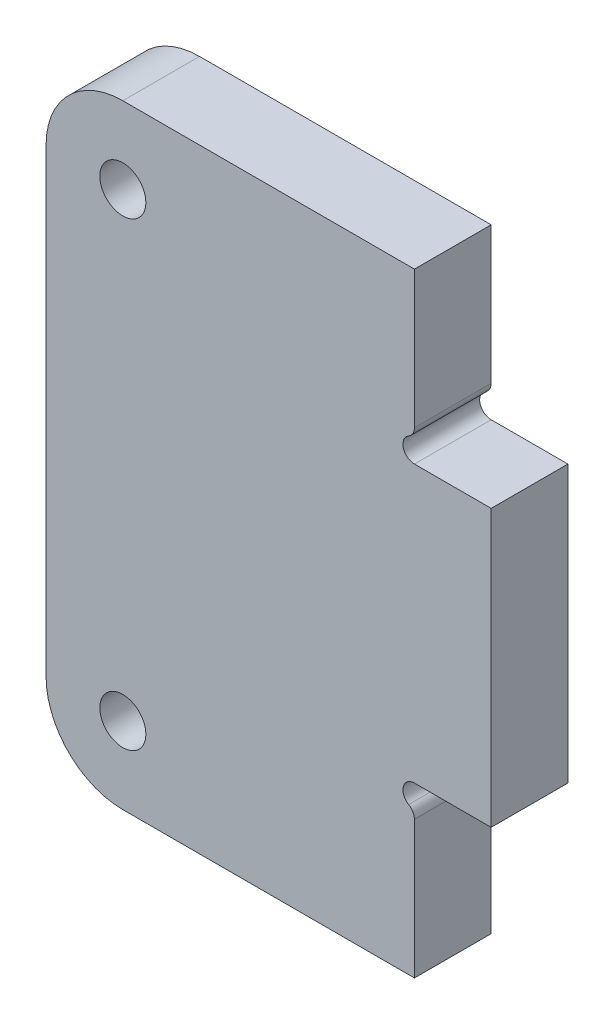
ISO-10303-21;
HEADER;
FILE_DESCRIPTION(('STEP AP214'),'2;1');
FILE_NAME('part.step','',(''),(''),'','','');
FILE_SCHEMA(('AUTOMOTIVE_DESIGN { 1 0 10303 214 1 1 1 1 }'));
ENDSEC;
DATA;
#1=APPLICATION_CONTEXT('core data for automotive mechanical design processes');
#2=APPLICATION_PROTOCOL_DEFINITION('international standard','automotive_design',2000,#1);
#3=PRODUCT_CONTEXT('',#1,'mechanical');
#4=PRODUCT('Part','Part','',(#3));
#5=PRODUCT_RELATED_PRODUCT_CATEGORY('part','',(#4));
#6=PRODUCT_DEFINITION_FORMATION('','',#4);
#7=PRODUCT_DEFINITION_CONTEXT('part definition',#1,'design');
#8=PRODUCT_DEFINITION('design','',#6,#7);
#9=PRODUCT_DEFINITION_SHAPE('','',#8);
#10=(LENGTH_UNIT() NAMED_UNIT(*) SI_UNIT(.MILLI.,.METRE.));
#11=(NAMED_UNIT(*) PLANE_ANGLE_UNIT() SI_UNIT($,.RADIAN.));
#12=(NAMED_UNIT(*) SI_UNIT($,.STERADIAN.) SOLID_ANGLE_UNIT());
#13=UNCERTAINTY_MEASURE_WITH_UNIT(LENGTH_MEASURE(1.E-05),#10,'distance_accuracy_value','');
#14=(GEOMETRIC_REPRESENTATION_CONTEXT(3) GLOBAL_UNCERTAINTY_ASSIGNED_CONTEXT((#13)) GLOBAL_UNIT_ASSIGNED_CONTEXT((#10,
#11,#12)) REPRESENTATION_CONTEXT('',''));
#15=CARTESIAN_POINT('',(0.,0.,0.));
#16=DIRECTION('',(0.,0.,1.));
#17=DIRECTION('',(1.,0.,0.));
#18=AXIS2_PLACEMENT_3D('',#15,#16,#17);
#19=CARTESIAN_POINT('',(26.5465583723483,-22.0980762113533,10.));
#20=DIRECTION('',(0.,0.,1.));
#21=DIRECTION('',(1.,0.,0.));
#22=AXIS2_PLACEMENT_3D('',#19,#20,#21);
#23=PLANE('',#22);
#24=CARTESIAN_POINT('',(-9.95344162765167,-30.,10.));
#25=DIRECTION('',(0.,0.,1.));
#26=DIRECTION('',(1.,0.,0.));
#27=AXIS2_PLACEMENT_3D('',#24,#25,#26);
#28=CIRCLE('',#27,2.9999999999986);
#29=CARTESIAN_POINT('',(-6.95344162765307,-30.,10.));
#30=VERTEX_POINT('',#29);
#31=EDGE_CURVE('E188',#30,#30,#28,.T.);
#32=ORIENTED_EDGE('',*,*,#31,.F.);
#33=EDGE_LOOP('',(#32));
#34=FACE_BOUND('',#33,.T.);
#35=CARTESIAN_POINT('',(26.5465583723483,-22.0980762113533,10.));
#36=DIRECTION('',(0.,0.,1.));
#37=DIRECTION('',(1.,0.,0.));
#38=AXIS2_PLACEMENT_3D('',#35,#36,#37);
#39=CIRCLE('',#38,1.5);
#40=CARTESIAN_POINT('',(28.0465583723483,-22.0980762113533,10.));
#41=VERTEX_POINT('',#40);
#42=CARTESIAN_POINT('',(27.2965583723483,-20.7990381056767,10.));
#43=VERTEX_POINT('',#42);
#44=EDGE_CURVE('E224',#41,#43,#39,.T.);
#45=ORIENTED_EDGE('',*,*,#44,.T.);
#46=CARTESIAN_POINT('',(28.0465583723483,-19.5,10.));
#47=DIRECTION('',(0.,0.,-1.));
#48=DIRECTION('',(1.,0.,0.));
#49=AXIS2_PLACEMENT_3D('',#46,#47,#48);
#50=CIRCLE('',#49,1.5);
#51=CARTESIAN_POINT('',(28.0465583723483,-18.,10.));
#52=VERTEX_POINT('',#51);
#53=EDGE_CURVE('E124',#43,#52,#50,.T.);
#54=ORIENTED_EDGE('',*,*,#53,.T.);
#55=DIRECTION('',(1.,0.,0.));
#56=VECTOR('',#55,1.);
#57=CARTESIAN_POINT('',(28.0465583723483,-18.,10.));
#58=LINE('',#57,#56);
#59=CARTESIAN_POINT('',(38.0465583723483,-18.,10.));
#60=VERTEX_POINT('',#59);
#61=EDGE_CURVE('E269',#52,#60,#58,.T.);
#62=ORIENTED_EDGE('',*,*,#61,.T.);
#63=DIRECTION('',(0.,1.,0.));
#64=VECTOR('',#63,1.);
#65=CARTESIAN_POINT('',(38.0465583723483,-18.,10.));
#66=LINE('',#65,#64);
#67=CARTESIAN_POINT('',(38.0465583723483,18.,10.));
#68=VERTEX_POINT('',#67);
#69=EDGE_CURVE('E289',#60,#68,#66,.T.);
#70=ORIENTED_EDGE('',*,*,#69,.T.);
#71=DIRECTION('',(-1.,0.,0.));
#72=VECTOR('',#71,1.);
#73=CARTESIAN_POINT('',(38.0465583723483,18.,10.));
#74=LINE('',#73,#72);
#75=CARTESIAN_POINT('',(28.0465583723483,18.,10.));
#76=VERTEX_POINT('',#75);
#77=EDGE_CURVE('E285',#68,#76,#74,.T.);
#78=ORIENTED_EDGE('',*,*,#77,.T.);
#79=CARTESIAN_POINT('',(28.0465583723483,19.5,10.));
#80=DIRECTION('',(0.,0.,-1.));
#81=DIRECTION('',(1.,0.,0.));
#82=AXIS2_PLACEMENT_3D('',#79,#80,#81);
#83=CIRCLE('',#82,1.5);
#84=CARTESIAN_POINT('',(27.2965583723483,20.7990381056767,10.));
#85=VERTEX_POINT('',#84);
#86=EDGE_CURVE('E288',#76,#85,#83,.T.);
#87=ORIENTED_EDGE('',*,*,#86,.T.);
#88=CARTESIAN_POINT('',(26.5465583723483,22.0980762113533,10.));
#89=DIRECTION('',(0.,0.,1.));
#90=DIRECTION('',(1.,0.,0.));
#91=AXIS2_PLACEMENT_3D('',#88,#89,#90);
#92=CIRCLE('',#91,1.5);
#93=CARTESIAN_POINT('',(28.0465583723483,22.0980762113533,10.));
#94=VERTEX_POINT('',#93);
#95=EDGE_CURVE('E293',#85,#94,#92,.T.);
#96=ORIENTED_EDGE('',*,*,#95,.T.);
#97=DIRECTION('',(0.,1.,0.));
#98=VECTOR('',#97,1.);
#99=CARTESIAN_POINT('',(28.0465583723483,22.0980762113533,10.));
#100=LINE('',#99,#98);
#101=CARTESIAN_POINT('',(28.0465583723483,40.,10.));
#102=VERTEX_POINT('',#101);
#103=EDGE_CURVE('E300',#94,#102,#100,.T.);
#104=ORIENTED_EDGE('',*,*,#103,.T.);
#105=DIRECTION('',(-1.,0.,0.));
#106=VECTOR('',#105,1.);
#107=CARTESIAN_POINT('',(28.0465583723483,40.,10.));
#108=LINE('',#107,#106);
#109=CARTESIAN_POINT('',(-9.9534416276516,40.,10.));
#110=VERTEX_POINT('',#109);
#111=EDGE_CURVE('E303',#102,#110,#108,.T.);
#112=ORIENTED_EDGE('',*,*,#111,.T.);
#113=CARTESIAN_POINT('',(-9.95344162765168,30.,10.));
#114=DIRECTION('',(0.,0.,1.));
#115=DIRECTION('',(1.,0.,0.));
#116=AXIS2_PLACEMENT_3D('',#113,#114,#115);
#117=CIRCLE('',#116,10.);
#118=CARTESIAN_POINT('',(-19.9534416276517,29.9999999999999,10.));
#119=VERTEX_POINT('',#118);
#120=EDGE_CURVE('E306',#110,#119,#117,.T.);
#121=ORIENTED_EDGE('',*,*,#120,.T.);
#122=DIRECTION('',(0.,-1.,0.));
#123=VECTOR('',#122,1.);
#124=CARTESIAN_POINT('',(-19.9534416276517,29.9999999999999,10.));
#125=LINE('',#124,#123);
#126=CARTESIAN_POINT('',(-19.9534416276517,-29.9999999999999,10.));
#127=VERTEX_POINT('',#126);
#128=EDGE_CURVE('E161',#119,#127,#125,.T.);
#129=ORIENTED_EDGE('',*,*,#128,.T.);
#130=CARTESIAN_POINT('',(-9.95344162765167,-30.,10.));
#131=DIRECTION('',(0.,0.,1.));
#132=DIRECTION('',(1.,0.,0.));
#133=AXIS2_PLACEMENT_3D('',#130,#131,#132);
#134=CIRCLE('',#133,10.);
#135=CARTESIAN_POINT('',(-9.9534416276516,-40.,10.));
#136=VERTEX_POINT('',#135);
#137=EDGE_CURVE('E155',#127,#136,#134,.T.);
#138=ORIENTED_EDGE('',*,*,#137,.T.);
#139=DIRECTION('',(1.,0.,0.));
#140=VECTOR('',#139,1.);
#141=CARTESIAN_POINT('',(-9.9534416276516,-40.,10.));
#142=LINE('',#141,#140);
#143=CARTESIAN_POINT('',(28.0465583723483,-40.,10.));
#144=VERTEX_POINT('',#143);
#145=EDGE_CURVE('E159',#136,#144,#142,.T.);
#146=ORIENTED_EDGE('',*,*,#145,.T.);
#147=DIRECTION('',(0.,1.,0.));
#148=VECTOR('',#147,1.);
#149=CARTESIAN_POINT('',(28.0465583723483,-40.,10.));
#150=LINE('',#149,#148);
#151=EDGE_CURVE('E63',#144,#41,#150,.T.);
#152=ORIENTED_EDGE('',*,*,#151,.T.);
#153=EDGE_LOOP('',(#45,#54,#62,#70,#78,#87,#96,#104,#112,#121,#129,#138,#146,#152));
#154=FACE_BOUND('',#153,.T.);
#155=CARTESIAN_POINT('',(-9.95344162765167,30.,10.));
#156=DIRECTION('',(0.,0.,1.));
#157=DIRECTION('',(1.,0.,0.));
#158=AXIS2_PLACEMENT_3D('',#155,#156,#157);
#159=CIRCLE('',#158,3.);
#160=CARTESIAN_POINT('',(-6.95344162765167,30.,10.));
#161=VERTEX_POINT('',#160);
#162=EDGE_CURVE('E350',#161,#161,#159,.T.);
#163=ORIENTED_EDGE('',*,*,#162,.F.);
#164=EDGE_LOOP('',(#163));
#165=FACE_BOUND('',#164,.T.);
#166=ADVANCED_FACE('F45',(#34,#154,#165),#23,.T.);
#167=CARTESIAN_POINT('',(26.5465583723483,-22.0980762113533,0.));
#168=DIRECTION('',(0.,0.,1.));
#169=DIRECTION('',(1.,0.,0.));
#170=AXIS2_PLACEMENT_3D('',#167,#168,#169);
#171=PLANE('',#170);
#172=CARTESIAN_POINT('',(26.5465583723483,-22.0980762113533,0.));
#173=DIRECTION('',(0.,0.,1.));
#174=DIRECTION('',(1.,0.,0.));
#175=AXIS2_PLACEMENT_3D('',#172,#173,#174);
#176=CIRCLE('',#175,1.5);
#177=CARTESIAN_POINT('',(28.0465583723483,-22.0980762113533,0.));
#178=VERTEX_POINT('',#177);
#179=CARTESIAN_POINT('',(27.2965583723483,-20.7990381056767,0.));
#180=VERTEX_POINT('',#179);
#181=EDGE_CURVE('E183',#178,#180,#176,.T.);
#182=ORIENTED_EDGE('',*,*,#181,.F.);
#183=DIRECTION('',(0.,1.,0.));
#184=VECTOR('',#183,1.);
#185=CARTESIAN_POINT('',(28.0465583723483,-40.,0.));
#186=LINE('',#185,#184);
#187=CARTESIAN_POINT('',(28.0465583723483,-40.,0.));
#188=VERTEX_POINT('',#187);
#189=EDGE_CURVE('E116',#188,#178,#186,.T.);
#190=ORIENTED_EDGE('',*,*,#189,.F.);
#191=DIRECTION('',(1.,0.,0.));
#192=VECTOR('',#191,1.);
#193=CARTESIAN_POINT('',(-9.9534416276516,-40.,0.));
#194=LINE('',#193,#192);
#195=CARTESIAN_POINT('',(-9.9534416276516,-40.,0.));
#196=VERTEX_POINT('',#195);
#197=EDGE_CURVE('E110',#196,#188,#194,.T.);
#198=ORIENTED_EDGE('',*,*,#197,.F.);
#199=CARTESIAN_POINT('',(-9.95344162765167,-30.,0.));
#200=DIRECTION('',(0.,0.,1.));
#201=DIRECTION('',(1.,0.,0.));
#202=AXIS2_PLACEMENT_3D('',#199,#200,#201);
#203=CIRCLE('',#202,10.);
#204=CARTESIAN_POINT('',(-19.9534416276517,-29.9999999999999,0.));
#205=VERTEX_POINT('',#204);
#206=EDGE_CURVE('E170',#205,#196,#203,.T.);
#207=ORIENTED_EDGE('',*,*,#206,.F.);
#208=DIRECTION('',(0.,-1.,0.));
#209=VECTOR('',#208,1.);
#210=CARTESIAN_POINT('',(-19.9534416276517,29.9999999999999,0.));
#211=LINE('',#210,#209);
#212=CARTESIAN_POINT('',(-19.9534416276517,29.9999999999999,0.));
#213=VERTEX_POINT('',#212);
#214=EDGE_CURVE('E215',#213,#205,#211,.T.);
#215=ORIENTED_EDGE('',*,*,#214,.F.);
#216=CARTESIAN_POINT('',(-9.95344162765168,30.,0.));
#217=DIRECTION('',(0.,0.,1.));
#218=DIRECTION('',(1.,0.,0.));
#219=AXIS2_PLACEMENT_3D('',#216,#217,#218);
#220=CIRCLE('',#219,10.);
#221=CARTESIAN_POINT('',(-9.9534416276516,40.,0.));
#222=VERTEX_POINT('',#221);
#223=EDGE_CURVE('E212',#222,#213,#220,.T.);
#224=ORIENTED_EDGE('',*,*,#223,.F.);
#225=DIRECTION('',(-1.,0.,0.));
#226=VECTOR('',#225,1.);
#227=CARTESIAN_POINT('',(28.0465583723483,40.,0.));
#228=LINE('',#227,#226);
#229=CARTESIAN_POINT('',(28.0465583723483,40.,0.));
#230=VERTEX_POINT('',#229);
#231=EDGE_CURVE('E209',#230,#222,#228,.T.);
#232=ORIENTED_EDGE('',*,*,#231,.F.);
#233=DIRECTION('',(0.,1.,0.));
#234=VECTOR('',#233,1.);
#235=CARTESIAN_POINT('',(28.0465583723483,22.0980762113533,0.));
#236=LINE('',#235,#234);
#237=CARTESIAN_POINT('',(28.0465583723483,22.0980762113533,0.));
#238=VERTEX_POINT('',#237);
#239=EDGE_CURVE('E206',#238,#230,#236,.T.);
#240=ORIENTED_EDGE('',*,*,#239,.F.);
#241=CARTESIAN_POINT('',(26.5465583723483,22.0980762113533,0.));
#242=DIRECTION('',(0.,0.,1.));
#243=DIRECTION('',(1.,0.,0.));
#244=AXIS2_PLACEMENT_3D('',#241,#242,#243);
#245=CIRCLE('',#244,1.5);
#246=CARTESIAN_POINT('',(27.2965583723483,20.7990381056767,0.));
#247=VERTEX_POINT('',#246);
#248=EDGE_CURVE('E203',#247,#238,#245,.T.);
#249=ORIENTED_EDGE('',*,*,#248,.F.);
#250=CARTESIAN_POINT('',(28.0465583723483,19.5,0.));
#251=DIRECTION('',(0.,0.,-1.));
#252=DIRECTION('',(1.,0.,0.));
#253=AXIS2_PLACEMENT_3D('',#250,#251,#252);
#254=CIRCLE('',#253,1.5);
#255=CARTESIAN_POINT('',(28.0465583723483,18.,0.));
#256=VERTEX_POINT('',#255);
#257=EDGE_CURVE('E200',#256,#247,#254,.T.);
#258=ORIENTED_EDGE('',*,*,#257,.F.);
#259=DIRECTION('',(-1.,0.,0.));
#260=VECTOR('',#259,1.);
#261=CARTESIAN_POINT('',(38.0465583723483,18.,0.));
#262=LINE('',#261,#260);
#263=CARTESIAN_POINT('',(38.0465583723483,18.,0.));
#264=VERTEX_POINT('',#263);
#265=EDGE_CURVE('E197',#264,#256,#262,.T.);
#266=ORIENTED_EDGE('',*,*,#265,.F.);
#267=DIRECTION('',(0.,1.,0.));
#268=VECTOR('',#267,1.);
#269=CARTESIAN_POINT('',(38.0465583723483,-18.,0.));
#270=LINE('',#269,#268);
#271=CARTESIAN_POINT('',(38.0465583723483,-18.,0.));
#272=VERTEX_POINT('',#271);
#273=EDGE_CURVE('E194',#272,#264,#270,.T.);
#274=ORIENTED_EDGE('',*,*,#273,.F.);
#275=DIRECTION('',(1.,0.,0.));
#276=VECTOR('',#275,1.);
#277=CARTESIAN_POINT('',(28.0465583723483,-18.,0.));
#278=LINE('',#277,#276);
#279=CARTESIAN_POINT('',(28.0465583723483,-18.,0.));
#280=VERTEX_POINT('',#279);
#281=EDGE_CURVE('E191',#280,#272,#278,.T.);
#282=ORIENTED_EDGE('',*,*,#281,.F.);
#283=CARTESIAN_POINT('',(28.0465583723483,-19.5,0.));
#284=DIRECTION('',(0.,0.,-1.));
#285=DIRECTION('',(1.,0.,0.));
#286=AXIS2_PLACEMENT_3D('',#283,#284,#285);
#287=CIRCLE('',#286,1.5);
#288=EDGE_CURVE('E187',#180,#280,#287,.T.);
#289=ORIENTED_EDGE('',*,*,#288,.F.);
#290=EDGE_LOOP('',(#182,#190,#198,#207,#215,#224,#232,#240,#249,#258,#266,#274,#282,#289));
#291=FACE_BOUND('',#290,.T.);
#292=CARTESIAN_POINT('',(-9.95344162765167,-30.,0.));
#293=DIRECTION('',(0.,0.,1.));
#294=DIRECTION('',(1.,0.,0.));
#295=AXIS2_PLACEMENT_3D('',#292,#293,#294);
#296=CIRCLE('',#295,2.9999999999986);
#297=CARTESIAN_POINT('',(-6.95344162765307,-30.,0.));
#298=VERTEX_POINT('',#297);
#299=EDGE_CURVE('E358',#298,#298,#296,.T.);
#300=ORIENTED_EDGE('',*,*,#299,.T.);
#301=EDGE_LOOP('',(#300));
#302=FACE_BOUND('',#301,.T.);
#303=CARTESIAN_POINT('',(-9.95344162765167,30.,0.));
#304=DIRECTION('',(0.,0.,1.));
#305=DIRECTION('',(1.,0.,0.));
#306=AXIS2_PLACEMENT_3D('',#303,#304,#305);
#307=CIRCLE('',#306,3.);
#308=CARTESIAN_POINT('',(-6.95344162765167,30.,0.));
#309=VERTEX_POINT('',#308);
#310=EDGE_CURVE('E353',#309,#309,#307,.T.);
#311=ORIENTED_EDGE('',*,*,#310,.T.);
#312=EDGE_LOOP('',(#311));
#313=FACE_BOUND('',#312,.T.);
#314=ADVANCED_FACE('F273',(#291,#302,#313),#171,.F.);
#315=CARTESIAN_POINT('',(26.5465583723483,-22.0980762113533,10.));
#316=DIRECTION('',(0.,0.,-1.));
#317=DIRECTION('',(-1.,0.,0.));
#318=AXIS2_PLACEMENT_3D('',#315,#316,#317);
#319=CYLINDRICAL_SURFACE('',#318,1.5);
#320=ORIENTED_EDGE('',*,*,#181,.T.);
#321=DIRECTION('',(0.,0.,-1.));
#322=VECTOR('',#321,1.);
#323=CARTESIAN_POINT('',(27.2965583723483,-20.7990381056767,10.));
#324=LINE('',#323,#322);
#325=EDGE_CURVE('E11',#43,#180,#324,.T.);
#326=ORIENTED_EDGE('',*,*,#325,.F.);
#327=ORIENTED_EDGE('',*,*,#44,.F.);
#328=DIRECTION('',(0.,0.,-1.));
#329=VECTOR('',#328,1.);
#330=CARTESIAN_POINT('',(28.0465583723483,-22.0980762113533,10.));
#331=LINE('',#330,#329);
#332=EDGE_CURVE('E179',#41,#178,#331,.T.);
#333=ORIENTED_EDGE('',*,*,#332,.T.);
#334=EDGE_LOOP('',(#320,#326,#327,#333));
#335=FACE_BOUND('',#334,.T.);
#336=ADVANCED_FACE('F47',(#335),#319,.T.);
#337=CARTESIAN_POINT('',(28.0465583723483,-19.5,10.));
#338=DIRECTION('',(0.,0.,-1.));
#339=DIRECTION('',(-1.,0.,0.));
#340=AXIS2_PLACEMENT_3D('',#337,#338,#339);
#341=CYLINDRICAL_SURFACE('',#340,1.5);
#342=ORIENTED_EDGE('',*,*,#288,.T.);
#343=DIRECTION('',(0.,0.,-1.));
#344=VECTOR('',#343,1.);
#345=CARTESIAN_POINT('',(28.0465583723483,-18.,10.));
#346=LINE('',#345,#344);
#347=EDGE_CURVE('E55',#52,#280,#346,.T.);
#348=ORIENTED_EDGE('',*,*,#347,.F.);
#349=ORIENTED_EDGE('',*,*,#53,.F.);
#350=ORIENTED_EDGE('',*,*,#325,.T.);
#351=EDGE_LOOP('',(#342,#348,#349,#350));
#352=FACE_BOUND('',#351,.T.);
#353=ADVANCED_FACE('F478',(#352),#341,.F.);
#354=CARTESIAN_POINT('',(28.0465583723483,-18.,10.));
#355=DIRECTION('',(0.,1.,0.));
#356=DIRECTION('',(-1.,0.,0.));
#357=AXIS2_PLACEMENT_3D('',#354,#355,#356);
#358=PLANE('',#357);
#359=ORIENTED_EDGE('',*,*,#281,.T.);
#360=DIRECTION('',(0.,0.,-1.));
#361=VECTOR('',#360,1.);
#362=CARTESIAN_POINT('',(38.0465583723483,-18.,10.));
#363=LINE('',#362,#361);
#364=EDGE_CURVE('E259',#60,#272,#363,.T.);
#365=ORIENTED_EDGE('',*,*,#364,.F.);
#366=ORIENTED_EDGE('',*,*,#61,.F.);
#367=ORIENTED_EDGE('',*,*,#347,.T.);
#368=EDGE_LOOP('',(#359,#365,#366,#367));
#369=FACE_BOUND('',#368,.T.);
#370=ADVANCED_FACE('F267',(#369),#358,.F.);
#371=CARTESIAN_POINT('',(38.0465583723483,-18.,10.));
#372=DIRECTION('',(-1.,0.,0.));
#373=DIRECTION('',(0.,0.,1.));
#374=AXIS2_PLACEMENT_3D('',#371,#372,#373);
#375=PLANE('',#374);
#376=ORIENTED_EDGE('',*,*,#273,.T.);
#377=DIRECTION('',(0.,0.,-1.));
#378=VECTOR('',#377,1.);
#379=CARTESIAN_POINT('',(38.0465583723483,18.,10.));
#380=LINE('',#379,#378);
#381=EDGE_CURVE('E255',#68,#264,#380,.T.);
#382=ORIENTED_EDGE('',*,*,#381,.F.);
#383=ORIENTED_EDGE('',*,*,#69,.F.);
#384=ORIENTED_EDGE('',*,*,#364,.T.);
#385=EDGE_LOOP('',(#376,#382,#383,#384));
#386=FACE_BOUND('',#385,.T.);
#387=ADVANCED_FACE('F279',(#386),#375,.F.);
#388=CARTESIAN_POINT('',(38.0465583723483,18.,10.));
#389=DIRECTION('',(0.,-1.,0.));
#390=DIRECTION('',(0.,0.,-1.));
#391=AXIS2_PLACEMENT_3D('',#388,#389,#390);
#392=PLANE('',#391);
#393=ORIENTED_EDGE('',*,*,#265,.T.);
#394=DIRECTION('',(0.,0.,-1.));
#395=VECTOR('',#394,1.);
#396=CARTESIAN_POINT('',(28.0465583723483,18.,10.));
#397=LINE('',#396,#395);
#398=EDGE_CURVE('E251',#76,#256,#397,.T.);
#399=ORIENTED_EDGE('',*,*,#398,.F.);
#400=ORIENTED_EDGE('',*,*,#77,.F.);
#401=ORIENTED_EDGE('',*,*,#381,.T.);
#402=EDGE_LOOP('',(#393,#399,#400,#401));
#403=FACE_BOUND('',#402,.T.);
#404=ADVANCED_FACE('F283',(#403),#392,.F.);
#405=CARTESIAN_POINT('',(28.0465583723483,19.5,10.));
#406=DIRECTION('',(0.,0.,-1.));
#407=DIRECTION('',(-1.,0.,0.));
#408=AXIS2_PLACEMENT_3D('',#405,#406,#407);
#409=CYLINDRICAL_SURFACE('',#408,1.5);
#410=ORIENTED_EDGE('',*,*,#257,.T.);
#411=DIRECTION('',(0.,0.,-1.));
#412=VECTOR('',#411,1.);
#413=CARTESIAN_POINT('',(27.2965583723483,20.7990381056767,10.));
#414=LINE('',#413,#412);
#415=EDGE_CURVE('E247',#85,#247,#414,.T.);
#416=ORIENTED_EDGE('',*,*,#415,.F.);
#417=ORIENTED_EDGE('',*,*,#86,.F.);
#418=ORIENTED_EDGE('',*,*,#398,.T.);
#419=EDGE_LOOP('',(#410,#416,#417,#418));
#420=FACE_BOUND('',#419,.T.);
#421=ADVANCED_FACE('F443',(#420),#409,.F.);
#422=CARTESIAN_POINT('',(26.5465583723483,22.0980762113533,10.));
#423=DIRECTION('',(0.,0.,-1.));
#424=DIRECTION('',(-1.,0.,0.));
#425=AXIS2_PLACEMENT_3D('',#422,#423,#424);
#426=CYLINDRICAL_SURFACE('',#425,1.5);
#427=ORIENTED_EDGE('',*,*,#248,.T.);
#428=DIRECTION('',(0.,0.,-1.));
#429=VECTOR('',#428,1.);
#430=CARTESIAN_POINT('',(28.0465583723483,22.0980762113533,10.));
#431=LINE('',#430,#429);
#432=EDGE_CURVE('E243',#94,#238,#431,.T.);
#433=ORIENTED_EDGE('',*,*,#432,.F.);
#434=ORIENTED_EDGE('',*,*,#95,.F.);
#435=ORIENTED_EDGE('',*,*,#415,.T.);
#436=EDGE_LOOP('',(#427,#433,#434,#435));
#437=FACE_BOUND('',#436,.T.);
#438=ADVANCED_FACE('F433',(#437),#426,.T.);
#439=CARTESIAN_POINT('',(28.0465583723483,22.0980762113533,10.));
#440=DIRECTION('',(-1.,0.,0.));
#441=DIRECTION('',(0.,0.,1.));
#442=AXIS2_PLACEMENT_3D('',#439,#440,#441);
#443=PLANE('',#442);
#444=ORIENTED_EDGE('',*,*,#239,.T.);
#445=DIRECTION('',(0.,0.,-1.));
#446=VECTOR('',#445,1.);
#447=CARTESIAN_POINT('',(28.0465583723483,40.,10.));
#448=LINE('',#447,#446);
#449=EDGE_CURVE('E239',#102,#230,#448,.T.);
#450=ORIENTED_EDGE('',*,*,#449,.F.);
#451=ORIENTED_EDGE('',*,*,#103,.F.);
#452=ORIENTED_EDGE('',*,*,#432,.T.);
#453=EDGE_LOOP('',(#444,#450,#451,#452));
#454=FACE_BOUND('',#453,.T.);
#455=ADVANCED_FACE('F423',(#454),#443,.F.);
#456=CARTESIAN_POINT('',(28.0465583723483,40.,10.));
#457=DIRECTION('',(0.,-1.,0.));
#458=DIRECTION('',(0.,0.,-1.));
#459=AXIS2_PLACEMENT_3D('',#456,#457,#458);
#460=PLANE('',#459);
#461=ORIENTED_EDGE('',*,*,#231,.T.);
#462=DIRECTION('',(0.,0.,-1.));
#463=VECTOR('',#462,1.);
#464=CARTESIAN_POINT('',(-9.9534416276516,40.,10.));
#465=LINE('',#464,#463);
#466=EDGE_CURVE('E235',#110,#222,#465,.T.);
#467=ORIENTED_EDGE('',*,*,#466,.F.);
#468=ORIENTED_EDGE('',*,*,#111,.F.);
#469=ORIENTED_EDGE('',*,*,#449,.T.);
#470=EDGE_LOOP('',(#461,#467,#468,#469));
#471=FACE_BOUND('',#470,.T.);
#472=ADVANCED_FACE('F414',(#471),#460,.F.);
#473=CARTESIAN_POINT('',(-9.95344162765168,30.,10.));
#474=DIRECTION('',(0.,0.,-1.));
#475=DIRECTION('',(-1.,0.,0.));
#476=AXIS2_PLACEMENT_3D('',#473,#474,#475);
#477=CYLINDRICAL_SURFACE('',#476,10.);
#478=ORIENTED_EDGE('',*,*,#223,.T.);
#479=DIRECTION('',(0.,0.,-1.));
#480=VECTOR('',#479,1.);
#481=CARTESIAN_POINT('',(-19.9534416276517,29.9999999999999,10.));
#482=LINE('',#481,#480);
#483=EDGE_CURVE('E231',#119,#213,#482,.T.);
#484=ORIENTED_EDGE('',*,*,#483,.F.);
#485=ORIENTED_EDGE('',*,*,#120,.F.);
#486=ORIENTED_EDGE('',*,*,#466,.T.);
#487=EDGE_LOOP('',(#478,#484,#485,#486));
#488=FACE_BOUND('',#487,.T.);
#489=ADVANCED_FACE('F314',(#488),#477,.T.);
#490=CARTESIAN_POINT('',(-19.9534416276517,29.9999999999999,10.));
#491=DIRECTION('',(1.,0.,0.));
#492=DIRECTION('',(0.,1.,0.));
#493=AXIS2_PLACEMENT_3D('',#490,#491,#492);
#494=PLANE('',#493);
#495=ORIENTED_EDGE('',*,*,#214,.T.);
#496=DIRECTION('',(0.,0.,-1.));
#497=VECTOR('',#496,1.);
#498=CARTESIAN_POINT('',(-19.9534416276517,-29.9999999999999,10.));
#499=LINE('',#498,#497);
#500=EDGE_CURVE('E172',#127,#205,#499,.T.);
#501=ORIENTED_EDGE('',*,*,#500,.F.);
#502=ORIENTED_EDGE('',*,*,#128,.F.);
#503=ORIENTED_EDGE('',*,*,#483,.T.);
#504=EDGE_LOOP('',(#495,#501,#502,#503));
#505=FACE_BOUND('',#504,.T.);
#506=ADVANCED_FACE('F318',(#505),#494,.F.);
#507=CARTESIAN_POINT('',(-9.95344162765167,-30.,10.));
#508=DIRECTION('',(0.,0.,-1.));
#509=DIRECTION('',(-1.,0.,0.));
#510=AXIS2_PLACEMENT_3D('',#507,#508,#509);
#511=CYLINDRICAL_SURFACE('',#510,10.);
#512=ORIENTED_EDGE('',*,*,#206,.T.);
#513=DIRECTION('',(0.,0.,-1.));
#514=VECTOR('',#513,1.);
#515=CARTESIAN_POINT('',(-9.9534416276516,-40.,10.));
#516=LINE('',#515,#514);
#517=EDGE_CURVE('E167',#136,#196,#516,.T.);
#518=ORIENTED_EDGE('',*,*,#517,.F.);
#519=ORIENTED_EDGE('',*,*,#137,.F.);
#520=ORIENTED_EDGE('',*,*,#500,.T.);
#521=EDGE_LOOP('',(#512,#518,#519,#520));
#522=FACE_BOUND('',#521,.T.);
#523=ADVANCED_FACE('F168',(#522),#511,.T.);
#524=CARTESIAN_POINT('',(-9.9534416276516,-40.,10.));
#525=DIRECTION('',(0.,1.,0.));
#526=DIRECTION('',(0.,0.,1.));
#527=AXIS2_PLACEMENT_3D('',#524,#525,#526);
#528=PLANE('',#527);
#529=ORIENTED_EDGE('',*,*,#197,.T.);
#530=DIRECTION('',(0.,0.,-1.));
#531=VECTOR('',#530,1.);
#532=CARTESIAN_POINT('',(28.0465583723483,-40.,10.));
#533=LINE('',#532,#531);
#534=EDGE_CURVE('E173',#144,#188,#533,.T.);
#535=ORIENTED_EDGE('',*,*,#534,.F.);
#536=ORIENTED_EDGE('',*,*,#145,.F.);
#537=ORIENTED_EDGE('',*,*,#517,.T.);
#538=EDGE_LOOP('',(#529,#535,#536,#537));
#539=FACE_BOUND('',#538,.T.);
#540=ADVANCED_FACE('F175',(#539),#528,.F.);
#541=CARTESIAN_POINT('',(28.0465583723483,-40.,10.));
#542=DIRECTION('',(-1.,0.,0.));
#543=DIRECTION('',(0.,-1.,0.));
#544=AXIS2_PLACEMENT_3D('',#541,#542,#543);
#545=PLANE('',#544);
#546=ORIENTED_EDGE('',*,*,#189,.T.);
#547=ORIENTED_EDGE('',*,*,#332,.F.);
#548=ORIENTED_EDGE('',*,*,#151,.F.);
#549=ORIENTED_EDGE('',*,*,#534,.T.);
#550=EDGE_LOOP('',(#546,#547,#548,#549));
#551=FACE_BOUND('',#550,.T.);
#552=ADVANCED_FACE('F322',(#551),#545,.F.);
#553=CARTESIAN_POINT('',(-9.95344162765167,-30.,10.));
#554=DIRECTION('',(0.,0.,-1.));
#555=DIRECTION('',(-1.,0.,0.));
#556=AXIS2_PLACEMENT_3D('',#553,#554,#555);
#557=CYLINDRICAL_SURFACE('',#556,2.9999999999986);
#558=ORIENTED_EDGE('',*,*,#31,.T.);
#559=EDGE_LOOP('',(#558));
#560=FACE_BOUND('',#559,.T.);
#561=ORIENTED_EDGE('',*,*,#299,.F.);
#562=EDGE_LOOP('',(#561));
#563=FACE_BOUND('',#562,.T.);
#564=ADVANCED_FACE('F324',(#560,#563),#557,.F.);
#565=CARTESIAN_POINT('',(-9.95344162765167,30.,10.));
#566=DIRECTION('',(0.,0.,-1.));
#567=DIRECTION('',(-1.,0.,0.));
#568=AXIS2_PLACEMENT_3D('',#565,#566,#567);
#569=CYLINDRICAL_SURFACE('',#568,3.);
#570=ORIENTED_EDGE('',*,*,#162,.T.);
#571=EDGE_LOOP('',(#570));
#572=FACE_BOUND('',#571,.T.);
#573=ORIENTED_EDGE('',*,*,#310,.F.);
#574=EDGE_LOOP('',(#573));
#575=FACE_BOUND('',#574,.T.);
#576=ADVANCED_FACE('F330',(#572,#575),#569,.F.);
#577=CLOSED_SHELL('',(#166,#314,#336,#353,#370,#387,#404,#421,#438,#455,#472,#489,#506,#523,
#540,#552,#564,#576));
#578=MANIFOLD_SOLID_BREP('B2',#577);
#579=ADVANCED_BREP_SHAPE_REPRESENTATION('',(#18,#578),#14);
#580=SHAPE_DEFINITION_REPRESENTATION(#9,#579);
ENDSEC;
END-ISO-10303-21;
